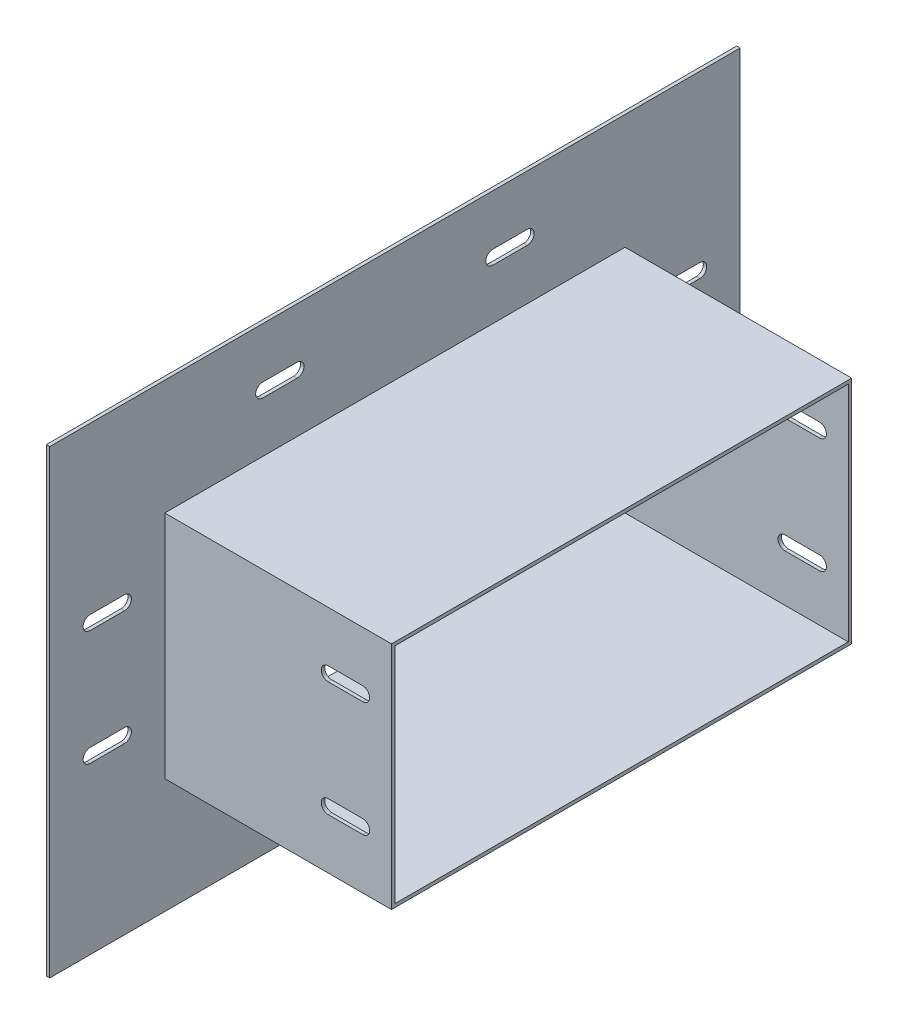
from build123d import *

# Parameters (mm, degrees)
SKETCH1_W               = 100
SKETCH1_H               = 200
SKETCH1_W_2             = 97
SKETCH1_H_2             = 197
EXTRUDE_THIN1_DEPTH     = 100
SKETCH2_W               = 300
SKETCH2_H               = 200
SKETCH2_W_2             = 200
SKETCH2_H_2             = 100
BOSS_EXTRUDE2_DEPTH     = 1.5
CUT_EXTRUDE1_DEPTH      = 207.155281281
CUT_EXTRUDE1_DEPTH_BACK = 207.155281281
CUT_EXTRUDE2_DEPTH      = 206.431862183


with BuildPart() as part:
    # Sketch1 → Extrude-Thin1 (new body)
    with BuildSketch(Plane(origin=(0, 0, 0), x_dir=(0, -1, 0), z_dir=(1, 0, 0))):
        Rectangle(SKETCH1_W, SKETCH1_H)
        Rectangle(SKETCH1_W_2, SKETCH1_H_2, mode=Mode.SUBTRACT)
    extrude(amount=EXTRUDE_THIN1_DEPTH)

    # Sketch2 → Boss-Extrude2 (add)
    with BuildSketch(Plane(origin=(0, 0, 0), x_dir=(0, 0, -1), z_dir=(1, 0, 0))):
        Rectangle(SKETCH2_W, SKETCH2_H)
        Rectangle(SKETCH2_W_2, SKETCH2_H_2, mode=Mode.SUBTRACT)
    extrude(amount=BOSS_EXTRUDE2_DEPTH)

    # Sketch3 → Cut-Extrude1 (cut, two sides: drawn at the far end of the back side and taken through both)
    with BuildSketch(Plane.XY.offset(-CUT_EXTRUDE1_DEPTH_BACK)):
        with BuildLine():
            Line((72.5, 28), (87.5, 28))
            ThreePointArc((87.5, 28), (90.5, 25), (87.5, 22))
            Line((87.5, 22), (72.5, 22))
            ThreePointArc((72.5, 22), (69.5, 25), (72.5, 28))
        make_face()
        with BuildLine():
            Line((72.5, -22), (87.5, -22))
            ThreePointArc((87.5, -22), (90.5, -25), (87.5, -28))
            Line((87.5, -28), (72.5, -28))
            ThreePointArc((72.5, -28), (69.5, -25), (72.5, -22))
        make_face()
    extrude(amount=CUT_EXTRUDE1_DEPTH + CUT_EXTRUDE1_DEPTH_BACK, mode=Mode.SUBTRACT)

    # Sketch4 → Cut-Extrude2 (cut, through all)
    with BuildSketch(Plane(origin=(1.5, 0, 0), x_dir=(0, 0, -1), z_dir=(1, 0, 0))):
        with BuildLine():
            Line((-57.5, 78), (-42.5, 78))
            ThreePointArc((-42.5, 78), (-39.5, 75), (-42.5, 72))
            Line((-42.5, 72), (-57.5, 72))
            ThreePointArc((-57.5, 72), (-60.5, 75), (-57.5, 78))
        make_face()
        with BuildLine():
            Line((-132.5, -22), (-117.5, -22))
            ThreePointArc((-117.5, -22), (-114.5, -25), (-117.5, -28))
            Line((-117.5, -28), (-132.5, -28))
            ThreePointArc((-132.5, -28), (-135.5, -25), (-132.5, -22))
        make_face()
        with BuildLine():
            Line((-132.5, 28), (-117.5, 28))
            ThreePointArc((-117.5, 28), (-114.5, 25), (-117.5, 22))
            Line((-117.5, 22), (-132.5, 22))
            ThreePointArc((-132.5, 22), (-135.5, 25), (-132.5, 28))
        make_face()
        with BuildLine():
            Line((-57.5, -72), (-42.5, -72))
            ThreePointArc((-42.5, -72), (-39.5, -75), (-42.5, -78))
            Line((-42.5, -78), (-57.5, -78))
            ThreePointArc((-57.5, -78), (-60.5, -75), (-57.5, -72))
        make_face()
        with BuildLine():
            Line((117.5, 28), (132.5, 28))
            ThreePointArc((132.5, 28), (135.5, 25), (132.5, 22))
            Line((132.5, 22), (117.5, 22))
            ThreePointArc((117.5, 22), (114.5, 25), (117.5, 28))
        make_face()
        with BuildLine():
            Line((42.5, -72), (57.5, -72))
            ThreePointArc((57.5, -72), (60.5, -75), (57.5, -78))
            Line((57.5, -78), (42.5, -78))
            ThreePointArc((42.5, -78), (39.5, -75), (42.5, -72))
        make_face()
        with BuildLine():
            Line((42.5, 78), (57.5, 78))
            ThreePointArc((57.5, 78), (60.5, 75), (57.5, 72))
            Line((57.5, 72), (42.5, 72))
            ThreePointArc((42.5, 72), (39.5, 75), (42.5, 78))
        make_face()
        with BuildLine():
            Line((117.5, -22), (132.5, -22))
            ThreePointArc((132.5, -22), (135.5, -25), (132.5, -28))
            Line((132.5, -28), (117.5, -28))
            ThreePointArc((117.5, -28), (114.5, -25), (117.5, -22))
        make_face()
    extrude(amount=-CUT_EXTRUDE2_DEPTH, mode=Mode.SUBTRACT)


solid = part.part
